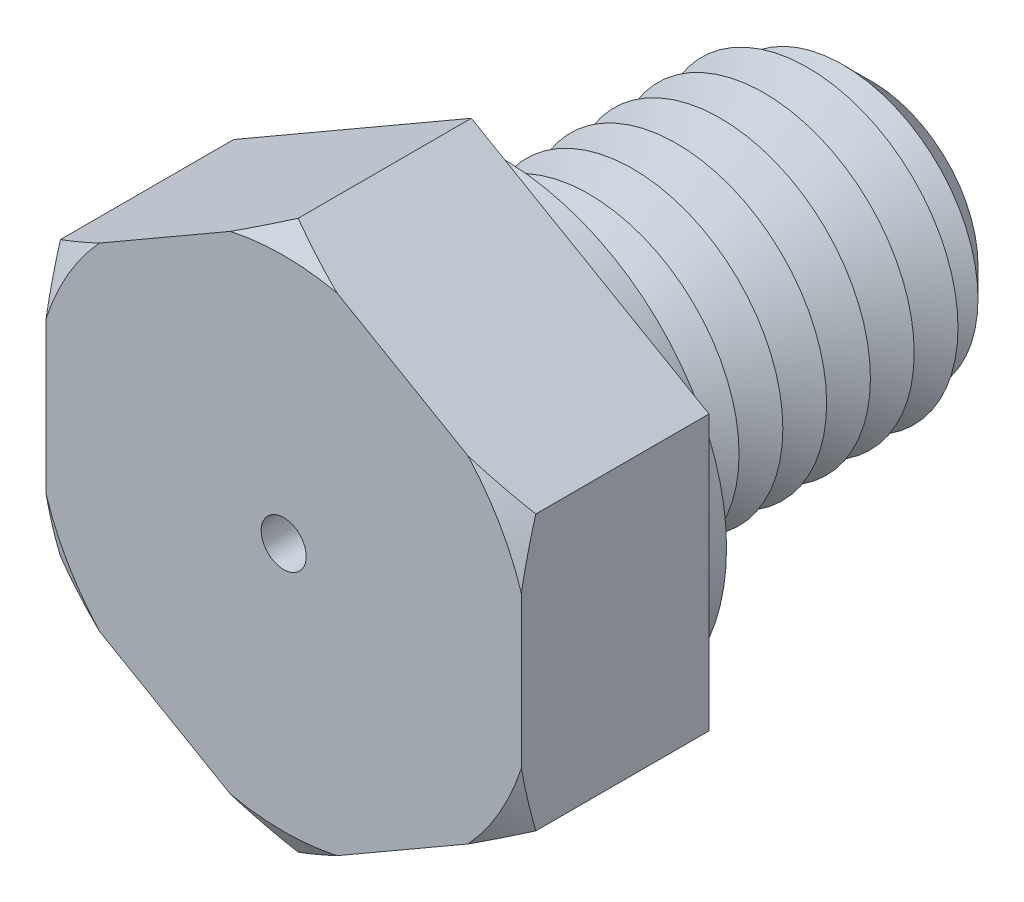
from build123d import *

# Parameters (mm, degrees)
BOSS_EXTRUDE1_DEPTH = 7.5
SKETCH3_R           = 6
BOSS_EXTRUDE2_DEPTH = 16
SKETCH4_R           = 9
BOSS_EXTRUDE3_DEPTH = 1.2
CHAMFER1_SIZE       = 1.75
LPATTERN1_COUNT     = 8
LPATTERN1_PITCH     = 1.75
SKETCH8_R           = 0.9
CUT_EXTRUDE1_DEPTH  = 23.5


with BuildPart() as part:
    # Sketch2 → Boss-Extrude1 (new body)
    with BuildSketch(Plane.XY):
        Polygon((0, 10.969655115), (-9.5, 5.484827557), (-9.5, -5.484827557), (0, -10.969655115), (9.5, -5.484827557), (9.5, 5.484827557), align=None)
    extrude(amount=BOSS_EXTRUDE1_DEPTH)

    # Sketch3 → Boss-Extrude2 (add)
    with BuildSketch(Plane(origin=(0, 0, 0), x_dir=(-1, 0, 0), z_dir=(0, 0, -1))):
        Circle(SKETCH3_R)
    extrude(amount=BOSS_EXTRUDE2_DEPTH)

    # Sketch4 → Boss-Extrude3 (add)
    with BuildSketch(Plane(origin=(0, 0, 0), x_dir=(-1, 0, 0), z_dir=(0, 0, -1))):
        with Locations(Location((0, 0, 0), (0, 0, 180))):
            Circle(SKETCH4_R)
    extrude(amount=BOSS_EXTRUDE3_DEPTH)

    # Chamfer1
    chamfer1_edges = [part.edges().sort_by_distance(p)[0] for p in [
        (6, 0, -16),
    ]]
    chamfer(chamfer1_edges, length=CHAMFER1_SIZE)

    # Sketch6 → Cut-Revolve1 (revolve, cut)
    with BuildSketch(Plane(origin=(0, 0, 0), x_dir=(0, 0, -1), z_dir=(1, 0, 0)), mode=Mode.PRIVATE) as cut_revolve1_sk:
        Polygon((1.2, 6), (2.075, 4.484455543), (2.95, 6), align=None)
    cut_revolve1 = revolve(cut_revolve1_sk.sketch.rotate(Axis((0, 0, 3.211670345), (0, 0, -1)), 90), axis=Axis((0, 0, 3.211670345), (0, 0, -1)), mode=Mode.SUBTRACT)

    # LPattern1: Cut-Revolve1 ×8
    with Locations(*[(0, 0, -i * LPATTERN1_PITCH) for i in range(1, LPATTERN1_COUNT)]):
        add(cut_revolve1, mode=Mode.SUBTRACT)

    # Sketch7 → Cut-Revolve2 (revolve, cut)
    with BuildSketch(Plane(origin=(0, 0, 0), x_dir=(0, 0, -1), z_dir=(1, 0, 0)), mode=Mode.PRIVATE) as cut_revolve2_sk:
        Polygon((-7.5, 10.969655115), (-7.5, 9.969655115), (-6.922649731, 10.969655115), align=None)
    revolve(cut_revolve2_sk.sketch.rotate(Axis((0, 0, 3.211670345), (0, 0, -1)), 90), axis=Axis((0, 0, 3.211670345), (0, 0, -1)), mode=Mode.SUBTRACT)

    # Sketch8 → Cut-Extrude1 (cut)
    with BuildSketch(Plane.XY.offset(7.5)):
        Circle(SKETCH8_R)
    extrude(amount=-CUT_EXTRUDE1_DEPTH, mode=Mode.SUBTRACT)


solid = part.part
